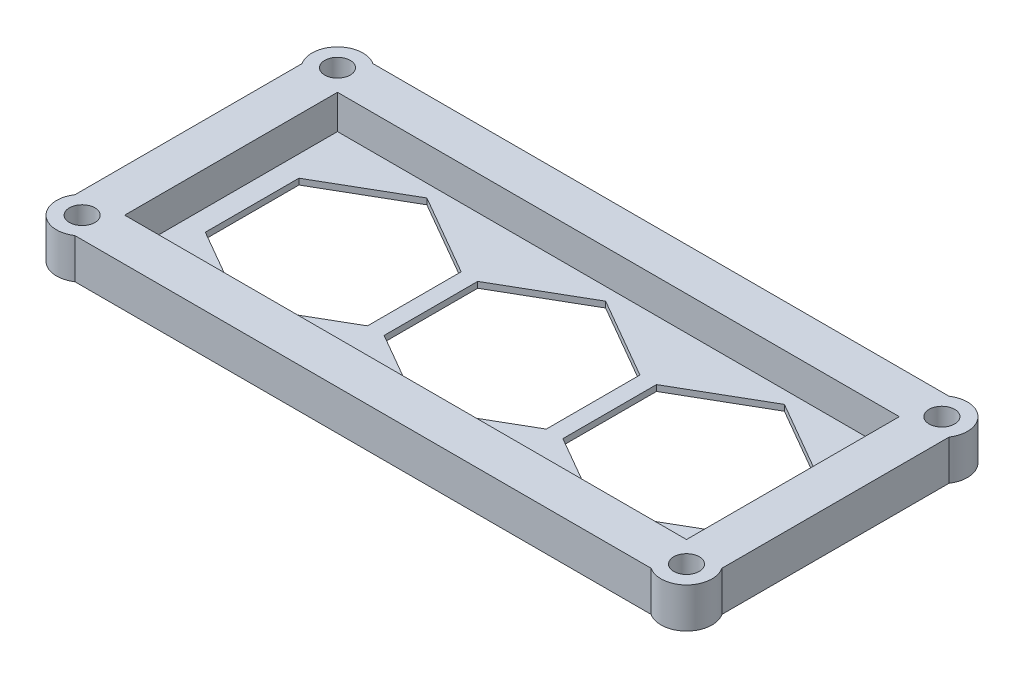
ISO-10303-21;
HEADER;
FILE_DESCRIPTION(('STEP AP214'),'2;1');
FILE_NAME('part.step','',(''),(''),'','','');
FILE_SCHEMA(('AUTOMOTIVE_DESIGN { 1 0 10303 214 1 1 1 1 }'));
ENDSEC;
DATA;
#1=APPLICATION_CONTEXT('core data for automotive mechanical design processes');
#2=APPLICATION_PROTOCOL_DEFINITION('international standard','automotive_design',2000,#1);
#3=PRODUCT_CONTEXT('',#1,'mechanical');
#4=PRODUCT('Part','Part','',(#3));
#5=PRODUCT_RELATED_PRODUCT_CATEGORY('part','',(#4));
#6=PRODUCT_DEFINITION_FORMATION('','',#4);
#7=PRODUCT_DEFINITION_CONTEXT('part definition',#1,'design');
#8=PRODUCT_DEFINITION('design','',#6,#7);
#9=PRODUCT_DEFINITION_SHAPE('','',#8);
#10=(LENGTH_UNIT() NAMED_UNIT(*) SI_UNIT(.MILLI.,.METRE.));
#11=(NAMED_UNIT(*) PLANE_ANGLE_UNIT() SI_UNIT($,.RADIAN.));
#12=(NAMED_UNIT(*) SI_UNIT($,.STERADIAN.) SOLID_ANGLE_UNIT());
#13=UNCERTAINTY_MEASURE_WITH_UNIT(LENGTH_MEASURE(1.E-05),#10,'distance_accuracy_value','');
#14=(GEOMETRIC_REPRESENTATION_CONTEXT(3) GLOBAL_UNCERTAINTY_ASSIGNED_CONTEXT((#13)) GLOBAL_UNIT_ASSIGNED_CONTEXT((#10,
#11,#12)) REPRESENTATION_CONTEXT('',''));
#15=CARTESIAN_POINT('',(0.,0.,0.));
#16=DIRECTION('',(0.,0.,1.));
#17=DIRECTION('',(1.,0.,0.));
#18=AXIS2_PLACEMENT_3D('',#15,#16,#17);
#19=CARTESIAN_POINT('',(31.7096354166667,0.7,-20.7083333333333));
#20=DIRECTION('',(0.,1.,0.));
#21=DIRECTION('',(0.,0.,1.));
#22=AXIS2_PLACEMENT_3D('',#19,#20,#21);
#23=PLANE('',#22);
#24=DIRECTION('',(-1.,0.,0.));
#25=VECTOR('',#24,1.);
#26=CARTESIAN_POINT('',(-36.7903645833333,0.7,-18.2083333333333));
#27=LINE('',#26,#25);
#28=CARTESIAN_POINT('',(29.2096354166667,0.7,-18.2083333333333));
#29=VERTEX_POINT('',#28);
#30=CARTESIAN_POINT('',(-36.7903645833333,0.7,-18.2083333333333));
#31=VERTEX_POINT('',#30);
#32=EDGE_CURVE('E47',#29,#31,#27,.T.);
#33=ORIENTED_EDGE('',*,*,#32,.T.);
#34=DIRECTION('',(0.,0.,1.));
#35=VECTOR('',#34,1.);
#36=CARTESIAN_POINT('',(-36.7903645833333,0.7,-18.2083333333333));
#37=LINE('',#36,#35);
#38=CARTESIAN_POINT('',(-36.7903645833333,0.7,6.79166666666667));
#39=VERTEX_POINT('',#38);
#40=EDGE_CURVE('E51',#31,#39,#37,.T.);
#41=ORIENTED_EDGE('',*,*,#40,.T.);
#42=DIRECTION('',(1.,0.,0.));
#43=VECTOR('',#42,1.);
#44=CARTESIAN_POINT('',(-36.7903645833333,0.7,6.79166666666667));
#45=LINE('',#44,#43);
#46=CARTESIAN_POINT('',(29.2096354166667,0.7,6.79166666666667));
#47=VERTEX_POINT('',#46);
#48=EDGE_CURVE('E260',#39,#47,#45,.T.);
#49=ORIENTED_EDGE('',*,*,#48,.T.);
#50=DIRECTION('',(0.,0.,-1.));
#51=VECTOR('',#50,1.);
#52=CARTESIAN_POINT('',(29.2096354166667,0.7,-18.2083333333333));
#53=LINE('',#52,#51);
#54=EDGE_CURVE('E238',#47,#29,#53,.T.);
#55=ORIENTED_EDGE('',*,*,#54,.T.);
#56=EDGE_LOOP('',(#33,#41,#49,#55));
#57=FACE_BOUND('',#56,.T.);
#58=DIRECTION('',(-0.866025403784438,0.,0.500000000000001));
#59=VECTOR('',#58,1.);
#60=CARTESIAN_POINT('',(17.2096354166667,0.7,-16.7083333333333));
#61=LINE('',#60,#59);
#62=CARTESIAN_POINT('',(17.2096354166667,0.7,-16.7083333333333));
#63=VERTEX_POINT('',#62);
#64=CARTESIAN_POINT('',(7.68335597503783,0.7,-11.2083333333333));
#65=VERTEX_POINT('',#64);
#66=EDGE_CURVE('E345',#63,#65,#61,.T.);
#67=ORIENTED_EDGE('',*,*,#66,.F.);
#68=DIRECTION('',(-0.866025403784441,0.,-0.499999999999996));
#69=VECTOR('',#68,1.);
#70=CARTESIAN_POINT('',(26.7359148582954,0.7,-11.2083333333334));
#71=LINE('',#70,#69);
#72=CARTESIAN_POINT('',(26.7359148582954,0.7,-11.2083333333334));
#73=VERTEX_POINT('',#72);
#74=EDGE_CURVE('E343',#73,#63,#71,.T.);
#75=ORIENTED_EDGE('',*,*,#74,.F.);
#76=DIRECTION('',(0.,0.,-1.));
#77=VECTOR('',#76,1.);
#78=CARTESIAN_POINT('',(26.7359148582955,0.7,-0.208333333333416));
#79=LINE('',#78,#77);
#80=CARTESIAN_POINT('',(26.7359148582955,0.7,-0.208333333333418));
#81=VERTEX_POINT('',#80);
#82=EDGE_CURVE('E355',#81,#73,#79,.T.);
#83=ORIENTED_EDGE('',*,*,#82,.F.);
#84=DIRECTION('',(0.866025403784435,0.,-0.500000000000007));
#85=VECTOR('',#84,1.);
#86=CARTESIAN_POINT('',(17.2096354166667,0.7,5.29166666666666));
#87=LINE('',#86,#85);
#88=CARTESIAN_POINT('',(17.2096354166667,0.7,5.29166666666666));
#89=VERTEX_POINT('',#88);
#90=EDGE_CURVE('E352',#89,#81,#87,.T.);
#91=ORIENTED_EDGE('',*,*,#90,.F.);
#92=DIRECTION('',(0.866025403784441,0.,0.499999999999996));
#93=VECTOR('',#92,1.);
#94=CARTESIAN_POINT('',(7.68335597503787,0.7,-0.208333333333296));
#95=LINE('',#94,#93);
#96=CARTESIAN_POINT('',(7.68335597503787,0.7,-0.208333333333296));
#97=VERTEX_POINT('',#96);
#98=EDGE_CURVE('E350',#97,#89,#95,.T.);
#99=ORIENTED_EDGE('',*,*,#98,.F.);
#100=DIRECTION('',(0.,0.,1.));
#101=VECTOR('',#100,1.);
#102=CARTESIAN_POINT('',(7.68335597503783,0.7,-11.2083333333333));
#103=LINE('',#102,#101);
#104=EDGE_CURVE('E348',#65,#97,#103,.T.);
#105=ORIENTED_EDGE('',*,*,#104,.F.);
#106=EDGE_LOOP('',(#67,#75,#83,#91,#99,#105));
#107=FACE_BOUND('',#106,.T.);
#108=DIRECTION('',(-0.866025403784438,0.,0.500000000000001));
#109=VECTOR('',#108,1.);
#110=CARTESIAN_POINT('',(-3.79036458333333,0.7,-16.7083333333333));
#111=LINE('',#110,#109);
#112=CARTESIAN_POINT('',(-3.79036458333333,0.7,-16.7083333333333));
#113=VERTEX_POINT('',#112);
#114=CARTESIAN_POINT('',(-13.3166440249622,0.7,-11.2083333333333));
#115=VERTEX_POINT('',#114);
#116=EDGE_CURVE('E390',#113,#115,#111,.T.);
#117=ORIENTED_EDGE('',*,*,#116,.F.);
#118=DIRECTION('',(-0.866025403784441,0.,-0.499999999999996));
#119=VECTOR('',#118,1.);
#120=CARTESIAN_POINT('',(5.73591485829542,0.7,-11.2083333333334));
#121=LINE('',#120,#119);
#122=CARTESIAN_POINT('',(5.73591485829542,0.7,-11.2083333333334));
#123=VERTEX_POINT('',#122);
#124=EDGE_CURVE('E388',#123,#113,#121,.T.);
#125=ORIENTED_EDGE('',*,*,#124,.F.);
#126=DIRECTION('',(0.,0.,-1.));
#127=VECTOR('',#126,1.);
#128=CARTESIAN_POINT('',(5.73591485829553,0.7,-0.208333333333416));
#129=LINE('',#128,#127);
#130=CARTESIAN_POINT('',(5.73591485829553,0.7,-0.208333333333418));
#131=VERTEX_POINT('',#130);
#132=EDGE_CURVE('E400',#131,#123,#129,.T.);
#133=ORIENTED_EDGE('',*,*,#132,.F.);
#134=DIRECTION('',(0.866025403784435,0.,-0.500000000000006));
#135=VECTOR('',#134,1.);
#136=CARTESIAN_POINT('',(-3.79036458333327,0.7,5.29166666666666));
#137=LINE('',#136,#135);
#138=CARTESIAN_POINT('',(-3.79036458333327,0.7,5.29166666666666));
#139=VERTEX_POINT('',#138);
#140=EDGE_CURVE('E397',#139,#131,#137,.T.);
#141=ORIENTED_EDGE('',*,*,#140,.F.);
#142=DIRECTION('',(0.866025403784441,0.,0.499999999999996));
#143=VECTOR('',#142,1.);
#144=CARTESIAN_POINT('',(-13.3166440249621,0.7,-0.208333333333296));
#145=LINE('',#144,#143);
#146=CARTESIAN_POINT('',(-13.3166440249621,0.7,-0.208333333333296));
#147=VERTEX_POINT('',#146);
#148=EDGE_CURVE('E395',#147,#139,#145,.T.);
#149=ORIENTED_EDGE('',*,*,#148,.F.);
#150=DIRECTION('',(0.,0.,1.));
#151=VECTOR('',#150,1.);
#152=CARTESIAN_POINT('',(-13.3166440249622,0.7,-11.2083333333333));
#153=LINE('',#152,#151);
#154=EDGE_CURVE('E393',#115,#147,#153,.T.);
#155=ORIENTED_EDGE('',*,*,#154,.F.);
#156=EDGE_LOOP('',(#117,#125,#133,#141,#149,#155));
#157=FACE_BOUND('',#156,.T.);
#158=DIRECTION('',(-0.866025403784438,0.,0.500000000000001));
#159=VECTOR('',#158,1.);
#160=CARTESIAN_POINT('',(-24.7903645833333,0.7,-16.7083333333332));
#161=LINE('',#160,#159);
#162=CARTESIAN_POINT('',(-24.7903645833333,0.7,-16.7083333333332));
#163=VERTEX_POINT('',#162);
#164=CARTESIAN_POINT('',(-34.3166440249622,0.7,-11.2083333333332));
#165=VERTEX_POINT('',#164);
#166=EDGE_CURVE('E300',#163,#165,#161,.T.);
#167=ORIENTED_EDGE('',*,*,#166,.F.);
#168=DIRECTION('',(-0.866025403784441,0.,-0.499999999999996));
#169=VECTOR('',#168,1.);
#170=CARTESIAN_POINT('',(-15.2640851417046,0.7,-11.2083333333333));
#171=LINE('',#170,#169);
#172=CARTESIAN_POINT('',(-15.2640851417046,0.7,-11.2083333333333));
#173=VERTEX_POINT('',#172);
#174=EDGE_CURVE('E298',#173,#163,#171,.T.);
#175=ORIENTED_EDGE('',*,*,#174,.F.);
#176=DIRECTION('',(0.,0.,-1.));
#177=VECTOR('',#176,1.);
#178=CARTESIAN_POINT('',(-15.2640851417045,0.7,-0.20833333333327));
#179=LINE('',#178,#177);
#180=CARTESIAN_POINT('',(-15.2640851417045,0.7,-0.208333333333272));
#181=VERTEX_POINT('',#180);
#182=EDGE_CURVE('E310',#181,#173,#179,.T.);
#183=ORIENTED_EDGE('',*,*,#182,.F.);
#184=DIRECTION('',(0.866025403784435,0.,-0.500000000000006));
#185=VECTOR('',#184,1.);
#186=CARTESIAN_POINT('',(-24.7903645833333,0.7,5.29166666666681));
#187=LINE('',#186,#185);
#188=CARTESIAN_POINT('',(-24.7903645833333,0.7,5.29166666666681));
#189=VERTEX_POINT('',#188);
#190=EDGE_CURVE('E307',#189,#181,#187,.T.);
#191=ORIENTED_EDGE('',*,*,#190,.F.);
#192=DIRECTION('',(0.866025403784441,0.,0.499999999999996));
#193=VECTOR('',#192,1.);
#194=CARTESIAN_POINT('',(-34.3166440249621,0.7,-0.208333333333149));
#195=LINE('',#194,#193);
#196=CARTESIAN_POINT('',(-34.3166440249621,0.7,-0.208333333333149));
#197=VERTEX_POINT('',#196);
#198=EDGE_CURVE('E305',#197,#189,#195,.T.);
#199=ORIENTED_EDGE('',*,*,#198,.F.);
#200=DIRECTION('',(0.,0.,1.));
#201=VECTOR('',#200,1.);
#202=CARTESIAN_POINT('',(-34.3166440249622,0.7,-11.2083333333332));
#203=LINE('',#202,#201);
#204=EDGE_CURVE('E303',#165,#197,#203,.T.);
#205=ORIENTED_EDGE('',*,*,#204,.F.);
#206=EDGE_LOOP('',(#167,#175,#183,#191,#199,#205));
#207=FACE_BOUND('',#206,.T.);
#208=ADVANCED_FACE('F32',(#57,#107,#157,#207),#23,.T.);
#209=CARTESIAN_POINT('',(31.7096354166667,0.,-20.7083333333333));
#210=DIRECTION('',(0.,1.,0.));
#211=DIRECTION('',(0.,0.,1.));
#212=AXIS2_PLACEMENT_3D('',#209,#210,#211);
#213=PLANE('',#212);
#214=DIRECTION('',(-0.866025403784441,0.,-0.499999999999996));
#215=VECTOR('',#214,1.);
#216=CARTESIAN_POINT('',(26.7359148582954,0.,-11.2083333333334));
#217=LINE('',#216,#215);
#218=CARTESIAN_POINT('',(26.7359148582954,0.,-11.2083333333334));
#219=VERTEX_POINT('',#218);
#220=CARTESIAN_POINT('',(17.2096354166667,0.,-16.7083333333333));
#221=VERTEX_POINT('',#220);
#222=EDGE_CURVE('E342',#219,#221,#217,.T.);
#223=ORIENTED_EDGE('',*,*,#222,.T.);
#224=DIRECTION('',(-0.866025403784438,0.,0.500000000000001));
#225=VECTOR('',#224,1.);
#226=CARTESIAN_POINT('',(17.2096354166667,0.,-16.7083333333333));
#227=LINE('',#226,#225);
#228=CARTESIAN_POINT('',(7.68335597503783,0.,-11.2083333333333));
#229=VERTEX_POINT('',#228);
#230=EDGE_CURVE('E360',#221,#229,#227,.T.);
#231=ORIENTED_EDGE('',*,*,#230,.T.);
#232=DIRECTION('',(0.,0.,1.));
#233=VECTOR('',#232,1.);
#234=CARTESIAN_POINT('',(7.68335597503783,0.,-11.2083333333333));
#235=LINE('',#234,#233);
#236=CARTESIAN_POINT('',(7.68335597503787,0.,-0.208333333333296));
#237=VERTEX_POINT('',#236);
#238=EDGE_CURVE('E363',#229,#237,#235,.T.);
#239=ORIENTED_EDGE('',*,*,#238,.T.);
#240=DIRECTION('',(0.866025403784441,0.,0.499999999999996));
#241=VECTOR('',#240,1.);
#242=CARTESIAN_POINT('',(7.68335597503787,0.,-0.208333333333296));
#243=LINE('',#242,#241);
#244=CARTESIAN_POINT('',(17.2096354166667,0.,5.29166666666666));
#245=VERTEX_POINT('',#244);
#246=EDGE_CURVE('E366',#237,#245,#243,.T.);
#247=ORIENTED_EDGE('',*,*,#246,.T.);
#248=DIRECTION('',(0.866025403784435,0.,-0.500000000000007));
#249=VECTOR('',#248,1.);
#250=CARTESIAN_POINT('',(17.2096354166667,0.,5.29166666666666));
#251=LINE('',#250,#249);
#252=CARTESIAN_POINT('',(26.7359148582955,0.,-0.208333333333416));
#253=VERTEX_POINT('',#252);
#254=EDGE_CURVE('E369',#245,#253,#251,.T.);
#255=ORIENTED_EDGE('',*,*,#254,.T.);
#256=DIRECTION('',(0.,0.,-1.));
#257=VECTOR('',#256,1.);
#258=CARTESIAN_POINT('',(26.7359148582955,0.,-0.208333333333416));
#259=LINE('',#258,#257);
#260=EDGE_CURVE('E346',#253,#219,#259,.T.);
#261=ORIENTED_EDGE('',*,*,#260,.T.);
#262=EDGE_LOOP('',(#223,#231,#239,#247,#255,#261));
#263=FACE_BOUND('',#262,.T.);
#264=CARTESIAN_POINT('',(31.7096354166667,0.,-20.7083333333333));
#265=DIRECTION('',(0.,1.,0.));
#266=DIRECTION('',(0.,0.,1.));
#267=AXIS2_PLACEMENT_3D('',#264,#265,#266);
#268=CIRCLE('',#267,1.5);
#269=CARTESIAN_POINT('',(31.7096354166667,0.,-19.2083333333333));
#270=VERTEX_POINT('',#269);
#271=EDGE_CURVE('E432',#270,#270,#268,.T.);
#272=ORIENTED_EDGE('',*,*,#271,.T.);
#273=EDGE_LOOP('',(#272));
#274=FACE_BOUND('',#273,.T.);
#275=CARTESIAN_POINT('',(-39.2903645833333,0.,9.29166666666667));
#276=DIRECTION('',(0.,1.,0.));
#277=DIRECTION('',(0.,0.,1.));
#278=AXIS2_PLACEMENT_3D('',#275,#276,#277);
#279=CIRCLE('',#278,1.5);
#280=CARTESIAN_POINT('',(-39.2903645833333,0.,10.7916666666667));
#281=VERTEX_POINT('',#280);
#282=EDGE_CURVE('E438',#281,#281,#279,.T.);
#283=ORIENTED_EDGE('',*,*,#282,.T.);
#284=EDGE_LOOP('',(#283));
#285=FACE_BOUND('',#284,.T.);
#286=CARTESIAN_POINT('',(31.7096354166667,0.,-20.7083333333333));
#287=DIRECTION('',(0.,1.,0.));
#288=DIRECTION('',(0.,0.,1.));
#289=AXIS2_PLACEMENT_3D('',#286,#287,#288);
#290=CIRCLE('',#289,3.);
#291=CARTESIAN_POINT('',(34.2096354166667,0.,-19.0500209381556));
#292=VERTEX_POINT('',#291);
#293=CARTESIAN_POINT('',(30.051323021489,0.,-23.2083333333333));
#294=VERTEX_POINT('',#293);
#295=EDGE_CURVE('E444',#292,#294,#290,.T.);
#296=ORIENTED_EDGE('',*,*,#295,.F.);
#297=DIRECTION('',(0.,0.,-1.));
#298=VECTOR('',#297,1.);
#299=CARTESIAN_POINT('',(34.2096354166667,0.,-19.0500209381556));
#300=LINE('',#299,#298);
#301=CARTESIAN_POINT('',(34.2096354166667,0.,7.63335427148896));
#302=VERTEX_POINT('',#301);
#303=EDGE_CURVE('E459',#302,#292,#300,.T.);
#304=ORIENTED_EDGE('',*,*,#303,.F.);
#305=CARTESIAN_POINT('',(31.7096354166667,0.,9.29166666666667));
#306=DIRECTION('',(0.,1.,0.));
#307=DIRECTION('',(0.,0.,1.));
#308=AXIS2_PLACEMENT_3D('',#305,#306,#307);
#309=CIRCLE('',#308,3.);
#310=CARTESIAN_POINT('',(30.051323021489,0.,11.7916666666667));
#311=VERTEX_POINT('',#310);
#312=EDGE_CURVE('E457',#311,#302,#309,.T.);
#313=ORIENTED_EDGE('',*,*,#312,.F.);
#314=DIRECTION('',(1.,0.,0.));
#315=VECTOR('',#314,1.);
#316=CARTESIAN_POINT('',(-37.6320521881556,0.,11.7916666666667));
#317=LINE('',#316,#315);
#318=CARTESIAN_POINT('',(-37.6320521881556,0.,11.7916666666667));
#319=VERTEX_POINT('',#318);
#320=EDGE_CURVE('E455',#319,#311,#317,.T.);
#321=ORIENTED_EDGE('',*,*,#320,.F.);
#322=CARTESIAN_POINT('',(-39.2903645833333,0.,9.29166666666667));
#323=DIRECTION('',(0.,1.,0.));
#324=DIRECTION('',(0.,0.,1.));
#325=AXIS2_PLACEMENT_3D('',#322,#323,#324);
#326=CIRCLE('',#325,3.);
#327=CARTESIAN_POINT('',(-41.7903645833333,0.,7.63335427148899));
#328=VERTEX_POINT('',#327);
#329=EDGE_CURVE('E453',#328,#319,#326,.T.);
#330=ORIENTED_EDGE('',*,*,#329,.F.);
#331=DIRECTION('',(0.,0.,1.));
#332=VECTOR('',#331,1.);
#333=CARTESIAN_POINT('',(-41.7903645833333,0.,-19.0500209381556));
#334=LINE('',#333,#332);
#335=CARTESIAN_POINT('',(-41.7903645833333,0.,-19.0500209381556));
#336=VERTEX_POINT('',#335);
#337=EDGE_CURVE('E451',#336,#328,#334,.T.);
#338=ORIENTED_EDGE('',*,*,#337,.F.);
#339=CARTESIAN_POINT('',(-39.2903645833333,0.,-20.7083333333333));
#340=DIRECTION('',(0.,1.,0.));
#341=DIRECTION('',(0.,0.,1.));
#342=AXIS2_PLACEMENT_3D('',#339,#340,#341);
#343=CIRCLE('',#342,3.);
#344=CARTESIAN_POINT('',(-37.6320521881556,0.,-23.2083333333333));
#345=VERTEX_POINT('',#344);
#346=EDGE_CURVE('E449',#345,#336,#343,.T.);
#347=ORIENTED_EDGE('',*,*,#346,.F.);
#348=DIRECTION('',(-1.,0.,0.));
#349=VECTOR('',#348,1.);
#350=CARTESIAN_POINT('',(-37.6320521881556,0.,-23.2083333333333));
#351=LINE('',#350,#349);
#352=EDGE_CURVE('E447',#294,#345,#351,.T.);
#353=ORIENTED_EDGE('',*,*,#352,.F.);
#354=EDGE_LOOP('',(#296,#304,#313,#321,#330,#338,#347,#353));
#355=FACE_BOUND('',#354,.T.);
#356=CARTESIAN_POINT('',(-39.2903645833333,0.,-20.7083333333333));
#357=DIRECTION('',(0.,1.,0.));
#358=DIRECTION('',(0.,0.,1.));
#359=AXIS2_PLACEMENT_3D('',#356,#357,#358);
#360=CIRCLE('',#359,1.5);
#361=CARTESIAN_POINT('',(-39.2903645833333,0.,-19.2083333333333));
#362=VERTEX_POINT('',#361);
#363=EDGE_CURVE('E441',#362,#362,#360,.T.);
#364=ORIENTED_EDGE('',*,*,#363,.T.);
#365=EDGE_LOOP('',(#364));
#366=FACE_BOUND('',#365,.T.);
#367=CARTESIAN_POINT('',(31.7096354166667,0.,9.29166666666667));
#368=DIRECTION('',(0.,1.,0.));
#369=DIRECTION('',(0.,0.,1.));
#370=AXIS2_PLACEMENT_3D('',#367,#368,#369);
#371=CIRCLE('',#370,1.5);
#372=CARTESIAN_POINT('',(31.7096354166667,0.,10.7916666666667));
#373=VERTEX_POINT('',#372);
#374=EDGE_CURVE('E435',#373,#373,#371,.T.);
#375=ORIENTED_EDGE('',*,*,#374,.T.);
#376=EDGE_LOOP('',(#375));
#377=FACE_BOUND('',#376,.T.);
#378=DIRECTION('',(-0.866025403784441,0.,-0.499999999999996));
#379=VECTOR('',#378,1.);
#380=CARTESIAN_POINT('',(5.73591485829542,0.,-11.2083333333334));
#381=LINE('',#380,#379);
#382=CARTESIAN_POINT('',(5.73591485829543,0.,-11.2083333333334));
#383=VERTEX_POINT('',#382);
#384=CARTESIAN_POINT('',(-3.79036458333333,0.,-16.7083333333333));
#385=VERTEX_POINT('',#384);
#386=EDGE_CURVE('E387',#383,#385,#381,.T.);
#387=ORIENTED_EDGE('',*,*,#386,.T.);
#388=DIRECTION('',(-0.866025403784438,0.,0.500000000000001));
#389=VECTOR('',#388,1.);
#390=CARTESIAN_POINT('',(-3.79036458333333,0.,-16.7083333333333));
#391=LINE('',#390,#389);
#392=CARTESIAN_POINT('',(-13.3166440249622,0.,-11.2083333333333));
#393=VERTEX_POINT('',#392);
#394=EDGE_CURVE('E405',#385,#393,#391,.T.);
#395=ORIENTED_EDGE('',*,*,#394,.T.);
#396=DIRECTION('',(0.,0.,1.));
#397=VECTOR('',#396,1.);
#398=CARTESIAN_POINT('',(-13.3166440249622,0.,-11.2083333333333));
#399=LINE('',#398,#397);
#400=CARTESIAN_POINT('',(-13.3166440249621,0.,-0.208333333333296));
#401=VERTEX_POINT('',#400);
#402=EDGE_CURVE('E408',#393,#401,#399,.T.);
#403=ORIENTED_EDGE('',*,*,#402,.T.);
#404=DIRECTION('',(0.866025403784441,0.,0.499999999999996));
#405=VECTOR('',#404,1.);
#406=CARTESIAN_POINT('',(-13.3166440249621,0.,-0.208333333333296));
#407=LINE('',#406,#405);
#408=CARTESIAN_POINT('',(-3.79036458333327,0.,5.29166666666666));
#409=VERTEX_POINT('',#408);
#410=EDGE_CURVE('E411',#401,#409,#407,.T.);
#411=ORIENTED_EDGE('',*,*,#410,.T.);
#412=DIRECTION('',(0.866025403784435,0.,-0.500000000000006));
#413=VECTOR('',#412,1.);
#414=CARTESIAN_POINT('',(-3.79036458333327,0.,5.29166666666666));
#415=LINE('',#414,#413);
#416=CARTESIAN_POINT('',(5.73591485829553,0.,-0.208333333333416));
#417=VERTEX_POINT('',#416);
#418=EDGE_CURVE('E414',#409,#417,#415,.T.);
#419=ORIENTED_EDGE('',*,*,#418,.T.);
#420=DIRECTION('',(0.,0.,-1.));
#421=VECTOR('',#420,1.);
#422=CARTESIAN_POINT('',(5.73591485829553,0.,-0.208333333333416));
#423=LINE('',#422,#421);
#424=EDGE_CURVE('E391',#417,#383,#423,.T.);
#425=ORIENTED_EDGE('',*,*,#424,.T.);
#426=EDGE_LOOP('',(#387,#395,#403,#411,#419,#425));
#427=FACE_BOUND('',#426,.T.);
#428=DIRECTION('',(-0.866025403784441,0.,-0.499999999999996));
#429=VECTOR('',#428,1.);
#430=CARTESIAN_POINT('',(-15.2640851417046,0.,-11.2083333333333));
#431=LINE('',#430,#429);
#432=CARTESIAN_POINT('',(-15.2640851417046,0.,-11.2083333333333));
#433=VERTEX_POINT('',#432);
#434=CARTESIAN_POINT('',(-24.7903645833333,0.,-16.7083333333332));
#435=VERTEX_POINT('',#434);
#436=EDGE_CURVE('E297',#433,#435,#431,.T.);
#437=ORIENTED_EDGE('',*,*,#436,.T.);
#438=DIRECTION('',(-0.866025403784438,0.,0.500000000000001));
#439=VECTOR('',#438,1.);
#440=CARTESIAN_POINT('',(-24.7903645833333,0.,-16.7083333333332));
#441=LINE('',#440,#439);
#442=CARTESIAN_POINT('',(-34.3166440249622,0.,-11.2083333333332));
#443=VERTEX_POINT('',#442);
#444=EDGE_CURVE('E315',#435,#443,#441,.T.);
#445=ORIENTED_EDGE('',*,*,#444,.T.);
#446=DIRECTION('',(0.,0.,1.));
#447=VECTOR('',#446,1.);
#448=CARTESIAN_POINT('',(-34.3166440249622,0.,-11.2083333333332));
#449=LINE('',#448,#447);
#450=CARTESIAN_POINT('',(-34.3166440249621,0.,-0.208333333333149));
#451=VERTEX_POINT('',#450);
#452=EDGE_CURVE('E318',#443,#451,#449,.T.);
#453=ORIENTED_EDGE('',*,*,#452,.T.);
#454=DIRECTION('',(0.866025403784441,0.,0.499999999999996));
#455=VECTOR('',#454,1.);
#456=CARTESIAN_POINT('',(-34.3166440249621,0.,-0.208333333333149));
#457=LINE('',#456,#455);
#458=CARTESIAN_POINT('',(-24.7903645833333,0.,5.29166666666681));
#459=VERTEX_POINT('',#458);
#460=EDGE_CURVE('E321',#451,#459,#457,.T.);
#461=ORIENTED_EDGE('',*,*,#460,.T.);
#462=DIRECTION('',(0.866025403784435,0.,-0.500000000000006));
#463=VECTOR('',#462,1.);
#464=CARTESIAN_POINT('',(-24.7903645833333,0.,5.29166666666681));
#465=LINE('',#464,#463);
#466=CARTESIAN_POINT('',(-15.2640851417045,0.,-0.20833333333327));
#467=VERTEX_POINT('',#466);
#468=EDGE_CURVE('E324',#459,#467,#465,.T.);
#469=ORIENTED_EDGE('',*,*,#468,.T.);
#470=DIRECTION('',(0.,0.,-1.));
#471=VECTOR('',#470,1.);
#472=CARTESIAN_POINT('',(-15.2640851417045,0.,-0.20833333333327));
#473=LINE('',#472,#471);
#474=EDGE_CURVE('E301',#467,#433,#473,.T.);
#475=ORIENTED_EDGE('',*,*,#474,.T.);
#476=EDGE_LOOP('',(#437,#445,#453,#461,#469,#475));
#477=FACE_BOUND('',#476,.T.);
#478=ADVANCED_FACE('F488',(#263,#274,#285,#355,#366,#377,#427,#477),#213,.F.);
#479=CARTESIAN_POINT('',(31.7096354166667,0.7,-20.7083333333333));
#480=DIRECTION('',(0.,-1.,0.));
#481=DIRECTION('',(0.,0.,-1.));
#482=AXIS2_PLACEMENT_3D('',#479,#480,#481);
#483=CYLINDRICAL_SURFACE('',#482,3.);
#484=ORIENTED_EDGE('',*,*,#295,.T.);
#485=DIRECTION('',(0.,-1.,0.));
#486=VECTOR('',#485,1.);
#487=CARTESIAN_POINT('',(30.051323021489,0.7,-23.2083333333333));
#488=LINE('',#487,#486);
#489=CARTESIAN_POINT('',(30.051323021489,4.7,-23.2083333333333));
#490=VERTEX_POINT('',#489);
#491=EDGE_CURVE('E11',#490,#294,#488,.T.);
#492=ORIENTED_EDGE('',*,*,#491,.F.);
#493=CARTESIAN_POINT('',(31.7096354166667,4.7,-20.7083333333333));
#494=DIRECTION('',(0.,1.,0.));
#495=DIRECTION('',(0.,0.,1.));
#496=AXIS2_PLACEMENT_3D('',#493,#494,#495);
#497=CIRCLE('',#496,3.);
#498=CARTESIAN_POINT('',(34.2096354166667,4.7,-19.0500209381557));
#499=VERTEX_POINT('',#498);
#500=EDGE_CURVE('E291',#499,#490,#497,.T.);
#501=ORIENTED_EDGE('',*,*,#500,.F.);
#502=DIRECTION('',(0.,-1.,0.));
#503=VECTOR('',#502,1.);
#504=CARTESIAN_POINT('',(34.2096354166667,0.7,-19.0500209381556));
#505=LINE('',#504,#503);
#506=EDGE_CURVE('E461',#499,#292,#505,.T.);
#507=ORIENTED_EDGE('',*,*,#506,.T.);
#508=EDGE_LOOP('',(#484,#492,#501,#507));
#509=FACE_BOUND('',#508,.T.);
#510=ADVANCED_FACE('F34',(#509),#483,.T.);
#511=CARTESIAN_POINT('',(-37.6320521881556,0.7,-23.2083333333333));
#512=DIRECTION('',(0.,0.,1.));
#513=DIRECTION('',(1.,0.,0.));
#514=AXIS2_PLACEMENT_3D('',#511,#512,#513);
#515=PLANE('',#514);
#516=ORIENTED_EDGE('',*,*,#352,.T.);
#517=DIRECTION('',(0.,-1.,0.));
#518=VECTOR('',#517,1.);
#519=CARTESIAN_POINT('',(-37.6320521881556,0.7,-23.2083333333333));
#520=LINE('',#519,#518);
#521=CARTESIAN_POINT('',(-37.6320521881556,4.7,-23.2083333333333));
#522=VERTEX_POINT('',#521);
#523=EDGE_CURVE('E40',#522,#345,#520,.T.);
#524=ORIENTED_EDGE('',*,*,#523,.F.);
#525=DIRECTION('',(-1.,0.,0.));
#526=VECTOR('',#525,1.);
#527=CARTESIAN_POINT('',(-37.6320521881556,4.7,-23.2083333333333));
#528=LINE('',#527,#526);
#529=EDGE_CURVE('E294',#490,#522,#528,.T.);
#530=ORIENTED_EDGE('',*,*,#529,.F.);
#531=ORIENTED_EDGE('',*,*,#491,.T.);
#532=EDGE_LOOP('',(#516,#524,#530,#531));
#533=FACE_BOUND('',#532,.T.);
#534=ADVANCED_FACE('F513',(#533),#515,.F.);
#535=CARTESIAN_POINT('',(-39.2903645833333,0.7,-20.7083333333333));
#536=DIRECTION('',(0.,-1.,0.));
#537=DIRECTION('',(0.,0.,-1.));
#538=AXIS2_PLACEMENT_3D('',#535,#536,#537);
#539=CYLINDRICAL_SURFACE('',#538,3.);
#540=ORIENTED_EDGE('',*,*,#346,.T.);
#541=DIRECTION('',(0.,-1.,0.));
#542=VECTOR('',#541,1.);
#543=CARTESIAN_POINT('',(-41.7903645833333,0.7,-19.0500209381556));
#544=LINE('',#543,#542);
#545=CARTESIAN_POINT('',(-41.7903645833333,4.7,-19.0500209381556));
#546=VERTEX_POINT('',#545);
#547=EDGE_CURVE('E476',#546,#336,#544,.T.);
#548=ORIENTED_EDGE('',*,*,#547,.F.);
#549=CARTESIAN_POINT('',(-39.2903645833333,4.7,-20.7083333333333));
#550=DIRECTION('',(0.,1.,0.));
#551=DIRECTION('',(0.,0.,1.));
#552=AXIS2_PLACEMENT_3D('',#549,#550,#551);
#553=CIRCLE('',#552,3.);
#554=EDGE_CURVE('E273',#522,#546,#553,.T.);
#555=ORIENTED_EDGE('',*,*,#554,.F.);
#556=ORIENTED_EDGE('',*,*,#523,.T.);
#557=EDGE_LOOP('',(#540,#548,#555,#556));
#558=FACE_BOUND('',#557,.T.);
#559=ADVANCED_FACE('F482',(#558),#539,.T.);
#560=CARTESIAN_POINT('',(-41.7903645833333,0.7,-19.0500209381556));
#561=DIRECTION('',(1.,0.,0.));
#562=DIRECTION('',(0.,0.,-1.));
#563=AXIS2_PLACEMENT_3D('',#560,#561,#562);
#564=PLANE('',#563);
#565=ORIENTED_EDGE('',*,*,#337,.T.);
#566=DIRECTION('',(0.,-1.,0.));
#567=VECTOR('',#566,1.);
#568=CARTESIAN_POINT('',(-41.7903645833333,0.7,7.63335427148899));
#569=LINE('',#568,#567);
#570=CARTESIAN_POINT('',(-41.7903645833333,4.7,7.63335427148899));
#571=VERTEX_POINT('',#570);
#572=EDGE_CURVE('E473',#571,#328,#569,.T.);
#573=ORIENTED_EDGE('',*,*,#572,.F.);
#574=DIRECTION('',(0.,0.,1.));
#575=VECTOR('',#574,1.);
#576=CARTESIAN_POINT('',(-41.7903645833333,4.7,-19.0500209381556));
#577=LINE('',#576,#575);
#578=EDGE_CURVE('E276',#546,#571,#577,.T.);
#579=ORIENTED_EDGE('',*,*,#578,.F.);
#580=ORIENTED_EDGE('',*,*,#547,.T.);
#581=EDGE_LOOP('',(#565,#573,#579,#580));
#582=FACE_BOUND('',#581,.T.);
#583=ADVANCED_FACE('F493',(#582),#564,.F.);
#584=CARTESIAN_POINT('',(-39.2903645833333,0.7,9.29166666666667));
#585=DIRECTION('',(0.,-1.,0.));
#586=DIRECTION('',(0.,0.,-1.));
#587=AXIS2_PLACEMENT_3D('',#584,#585,#586);
#588=CYLINDRICAL_SURFACE('',#587,3.);
#589=ORIENTED_EDGE('',*,*,#329,.T.);
#590=DIRECTION('',(0.,-1.,0.));
#591=VECTOR('',#590,1.);
#592=CARTESIAN_POINT('',(-37.6320521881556,0.7,11.7916666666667));
#593=LINE('',#592,#591);
#594=CARTESIAN_POINT('',(-37.6320521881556,4.7,11.7916666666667));
#595=VERTEX_POINT('',#594);
#596=EDGE_CURVE('E470',#595,#319,#593,.T.);
#597=ORIENTED_EDGE('',*,*,#596,.F.);
#598=CARTESIAN_POINT('',(-39.2903645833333,4.7,9.29166666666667));
#599=DIRECTION('',(0.,1.,0.));
#600=DIRECTION('',(0.,0.,1.));
#601=AXIS2_PLACEMENT_3D('',#598,#599,#600);
#602=CIRCLE('',#601,3.);
#603=EDGE_CURVE('E279',#571,#595,#602,.T.);
#604=ORIENTED_EDGE('',*,*,#603,.F.);
#605=ORIENTED_EDGE('',*,*,#572,.T.);
#606=EDGE_LOOP('',(#589,#597,#604,#605));
#607=FACE_BOUND('',#606,.T.);
#608=ADVANCED_FACE('F497',(#607),#588,.T.);
#609=CARTESIAN_POINT('',(-37.6320521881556,0.7,11.7916666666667));
#610=DIRECTION('',(0.,0.,-1.));
#611=DIRECTION('',(-1.,0.,0.));
#612=AXIS2_PLACEMENT_3D('',#609,#610,#611);
#613=PLANE('',#612);
#614=ORIENTED_EDGE('',*,*,#320,.T.);
#615=DIRECTION('',(0.,-1.,0.));
#616=VECTOR('',#615,1.);
#617=CARTESIAN_POINT('',(30.051323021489,0.7,11.7916666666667));
#618=LINE('',#617,#616);
#619=CARTESIAN_POINT('',(30.051323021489,4.7,11.7916666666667));
#620=VERTEX_POINT('',#619);
#621=EDGE_CURVE('E467',#620,#311,#618,.T.);
#622=ORIENTED_EDGE('',*,*,#621,.F.);
#623=DIRECTION('',(1.,0.,0.));
#624=VECTOR('',#623,1.);
#625=CARTESIAN_POINT('',(-37.6320521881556,4.7,11.7916666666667));
#626=LINE('',#625,#624);
#627=EDGE_CURVE('E282',#595,#620,#626,.T.);
#628=ORIENTED_EDGE('',*,*,#627,.F.);
#629=ORIENTED_EDGE('',*,*,#596,.T.);
#630=EDGE_LOOP('',(#614,#622,#628,#629));
#631=FACE_BOUND('',#630,.T.);
#632=ADVANCED_FACE('F503',(#631),#613,.F.);
#633=CARTESIAN_POINT('',(31.7096354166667,0.7,9.29166666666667));
#634=DIRECTION('',(0.,-1.,0.));
#635=DIRECTION('',(0.,0.,-1.));
#636=AXIS2_PLACEMENT_3D('',#633,#634,#635);
#637=CYLINDRICAL_SURFACE('',#636,3.);
#638=ORIENTED_EDGE('',*,*,#312,.T.);
#639=DIRECTION('',(0.,-1.,0.));
#640=VECTOR('',#639,1.);
#641=CARTESIAN_POINT('',(34.2096354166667,0.7,7.63335427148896));
#642=LINE('',#641,#640);
#643=CARTESIAN_POINT('',(34.2096354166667,4.7,7.63335427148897));
#644=VERTEX_POINT('',#643);
#645=EDGE_CURVE('E464',#644,#302,#642,.T.);
#646=ORIENTED_EDGE('',*,*,#645,.F.);
#647=CARTESIAN_POINT('',(31.7096354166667,4.7,9.29166666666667));
#648=DIRECTION('',(0.,1.,0.));
#649=DIRECTION('',(0.,0.,1.));
#650=AXIS2_PLACEMENT_3D('',#647,#648,#649);
#651=CIRCLE('',#650,3.);
#652=EDGE_CURVE('E285',#620,#644,#651,.T.);
#653=ORIENTED_EDGE('',*,*,#652,.F.);
#654=ORIENTED_EDGE('',*,*,#621,.T.);
#655=EDGE_LOOP('',(#638,#646,#653,#654));
#656=FACE_BOUND('',#655,.T.);
#657=ADVANCED_FACE('F506',(#656),#637,.T.);
#658=CARTESIAN_POINT('',(34.2096354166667,0.7,-19.0500209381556));
#659=DIRECTION('',(-1.,0.,0.));
#660=DIRECTION('',(0.,0.,1.));
#661=AXIS2_PLACEMENT_3D('',#658,#659,#660);
#662=PLANE('',#661);
#663=ORIENTED_EDGE('',*,*,#303,.T.);
#664=ORIENTED_EDGE('',*,*,#506,.F.);
#665=DIRECTION('',(0.,0.,-1.));
#666=VECTOR('',#665,1.);
#667=CARTESIAN_POINT('',(34.2096354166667,4.7,-19.0500209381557));
#668=LINE('',#667,#666);
#669=EDGE_CURVE('E288',#644,#499,#668,.T.);
#670=ORIENTED_EDGE('',*,*,#669,.F.);
#671=ORIENTED_EDGE('',*,*,#645,.T.);
#672=EDGE_LOOP('',(#663,#664,#670,#671));
#673=FACE_BOUND('',#672,.T.);
#674=ADVANCED_FACE('F509',(#673),#662,.F.);
#675=CARTESIAN_POINT('',(-39.2903645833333,0.7,-20.7083333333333));
#676=DIRECTION('',(0.,-1.,0.));
#677=DIRECTION('',(0.,0.,-1.));
#678=AXIS2_PLACEMENT_3D('',#675,#676,#677);
#679=CYLINDRICAL_SURFACE('',#678,1.5);
#680=ORIENTED_EDGE('',*,*,#363,.F.);
#681=EDGE_LOOP('',(#680));
#682=FACE_BOUND('',#681,.T.);
#683=CARTESIAN_POINT('',(-39.2903645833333,4.7,-20.7083333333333));
#684=DIRECTION('',(0.,1.,0.));
#685=DIRECTION('',(0.,0.,1.));
#686=AXIS2_PLACEMENT_3D('',#683,#684,#685);
#687=CIRCLE('',#686,1.5);
#688=CARTESIAN_POINT('',(-39.2903645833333,4.7,-19.2083333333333));
#689=VERTEX_POINT('',#688);
#690=EDGE_CURVE('E243',#689,#689,#687,.T.);
#691=ORIENTED_EDGE('',*,*,#690,.T.);
#692=EDGE_LOOP('',(#691));
#693=FACE_BOUND('',#692,.T.);
#694=ADVANCED_FACE('F529',(#682,#693),#679,.F.);
#695=CARTESIAN_POINT('',(-39.2903645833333,0.7,9.29166666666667));
#696=DIRECTION('',(0.,-1.,0.));
#697=DIRECTION('',(0.,0.,-1.));
#698=AXIS2_PLACEMENT_3D('',#695,#696,#697);
#699=CYLINDRICAL_SURFACE('',#698,1.5);
#700=ORIENTED_EDGE('',*,*,#282,.F.);
#701=EDGE_LOOP('',(#700));
#702=FACE_BOUND('',#701,.T.);
#703=CARTESIAN_POINT('',(-39.2903645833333,4.7,9.29166666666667));
#704=DIRECTION('',(0.,1.,0.));
#705=DIRECTION('',(0.,0.,1.));
#706=AXIS2_PLACEMENT_3D('',#703,#704,#705);
#707=CIRCLE('',#706,1.5);
#708=CARTESIAN_POINT('',(-39.2903645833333,4.7,10.7916666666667));
#709=VERTEX_POINT('',#708);
#710=EDGE_CURVE('E270',#709,#709,#707,.T.);
#711=ORIENTED_EDGE('',*,*,#710,.T.);
#712=EDGE_LOOP('',(#711));
#713=FACE_BOUND('',#712,.T.);
#714=ADVANCED_FACE('F567',(#702,#713),#699,.F.);
#715=CARTESIAN_POINT('',(31.7096354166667,0.7,9.29166666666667));
#716=DIRECTION('',(0.,-1.,0.));
#717=DIRECTION('',(0.,0.,-1.));
#718=AXIS2_PLACEMENT_3D('',#715,#716,#717);
#719=CYLINDRICAL_SURFACE('',#718,1.5);
#720=ORIENTED_EDGE('',*,*,#374,.F.);
#721=EDGE_LOOP('',(#720));
#722=FACE_BOUND('',#721,.T.);
#723=CARTESIAN_POINT('',(31.7096354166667,4.7,9.29166666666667));
#724=DIRECTION('',(0.,1.,0.));
#725=DIRECTION('',(0.,0.,1.));
#726=AXIS2_PLACEMENT_3D('',#723,#724,#725);
#727=CIRCLE('',#726,1.5);
#728=CARTESIAN_POINT('',(31.7096354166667,4.7,10.7916666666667));
#729=VERTEX_POINT('',#728);
#730=EDGE_CURVE('E903',#729,#729,#727,.T.);
#731=ORIENTED_EDGE('',*,*,#730,.T.);
#732=EDGE_LOOP('',(#731));
#733=FACE_BOUND('',#732,.T.);
#734=ADVANCED_FACE('F574',(#722,#733),#719,.F.);
#735=CARTESIAN_POINT('',(31.7096354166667,0.7,-20.7083333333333));
#736=DIRECTION('',(0.,-1.,0.));
#737=DIRECTION('',(0.,0.,-1.));
#738=AXIS2_PLACEMENT_3D('',#735,#736,#737);
#739=CYLINDRICAL_SURFACE('',#738,1.5);
#740=ORIENTED_EDGE('',*,*,#271,.F.);
#741=EDGE_LOOP('',(#740));
#742=FACE_BOUND('',#741,.T.);
#743=CARTESIAN_POINT('',(31.7096354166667,4.7,-20.7083333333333));
#744=DIRECTION('',(0.,1.,0.));
#745=DIRECTION('',(0.,0.,1.));
#746=AXIS2_PLACEMENT_3D('',#743,#744,#745);
#747=CIRCLE('',#746,1.5);
#748=CARTESIAN_POINT('',(31.7096354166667,4.7,-19.2083333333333));
#749=VERTEX_POINT('',#748);
#750=EDGE_CURVE('E258',#749,#749,#747,.T.);
#751=ORIENTED_EDGE('',*,*,#750,.T.);
#752=EDGE_LOOP('',(#751));
#753=FACE_BOUND('',#752,.T.);
#754=ADVANCED_FACE('F581',(#742,#753),#739,.F.);
#755=CARTESIAN_POINT('',(5.73591485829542,0.7,-11.2083333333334));
#756=DIRECTION('',(-0.499999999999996,0.,0.866025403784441));
#757=DIRECTION('',(0.866025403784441,0.,0.499999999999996));
#758=AXIS2_PLACEMENT_3D('',#755,#756,#757);
#759=PLANE('',#758);
#760=ORIENTED_EDGE('',*,*,#386,.F.);
#761=DIRECTION('',(0.,-1.,0.));
#762=VECTOR('',#761,1.);
#763=CARTESIAN_POINT('',(5.73591485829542,0.7,-11.2083333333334));
#764=LINE('',#763,#762);
#765=EDGE_CURVE('E402',#123,#383,#764,.T.);
#766=ORIENTED_EDGE('',*,*,#765,.F.);
#767=ORIENTED_EDGE('',*,*,#124,.T.);
#768=DIRECTION('',(0.,-1.,0.));
#769=VECTOR('',#768,1.);
#770=CARTESIAN_POINT('',(-3.79036458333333,0.7,-16.7083333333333));
#771=LINE('',#770,#769);
#772=EDGE_CURVE('E429',#113,#385,#771,.T.);
#773=ORIENTED_EDGE('',*,*,#772,.T.);
#774=EDGE_LOOP('',(#760,#766,#767,#773));
#775=FACE_BOUND('',#774,.T.);
#776=ADVANCED_FACE('F589',(#775),#759,.T.);
#777=CARTESIAN_POINT('',(-3.79036458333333,0.7,-16.7083333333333));
#778=DIRECTION('',(0.500000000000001,0.,0.866025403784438));
#779=DIRECTION('',(0.866025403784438,0.,-0.500000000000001));
#780=AXIS2_PLACEMENT_3D('',#777,#778,#779);
#781=PLANE('',#780);
#782=ORIENTED_EDGE('',*,*,#394,.F.);
#783=ORIENTED_EDGE('',*,*,#772,.F.);
#784=ORIENTED_EDGE('',*,*,#116,.T.);
#785=DIRECTION('',(0.,-1.,0.));
#786=VECTOR('',#785,1.);
#787=CARTESIAN_POINT('',(-13.3166440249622,0.7,-11.2083333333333));
#788=LINE('',#787,#786);
#789=EDGE_CURVE('E427',#115,#393,#788,.T.);
#790=ORIENTED_EDGE('',*,*,#789,.T.);
#791=EDGE_LOOP('',(#782,#783,#784,#790));
#792=FACE_BOUND('',#791,.T.);
#793=ADVANCED_FACE('F598',(#792),#781,.T.);
#794=CARTESIAN_POINT('',(-13.3166440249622,0.7,-11.2083333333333));
#795=DIRECTION('',(1.,0.,0.));
#796=DIRECTION('',(0.,0.,-1.));
#797=AXIS2_PLACEMENT_3D('',#794,#795,#796);
#798=PLANE('',#797);
#799=ORIENTED_EDGE('',*,*,#402,.F.);
#800=ORIENTED_EDGE('',*,*,#789,.F.);
#801=ORIENTED_EDGE('',*,*,#154,.T.);
#802=DIRECTION('',(0.,-1.,0.));
#803=VECTOR('',#802,1.);
#804=CARTESIAN_POINT('',(-13.3166440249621,0.7,-0.208333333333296));
#805=LINE('',#804,#803);
#806=EDGE_CURVE('E425',#147,#401,#805,.T.);
#807=ORIENTED_EDGE('',*,*,#806,.T.);
#808=EDGE_LOOP('',(#799,#800,#801,#807));
#809=FACE_BOUND('',#808,.T.);
#810=ADVANCED_FACE('F607',(#809),#798,.T.);
#811=CARTESIAN_POINT('',(-13.3166440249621,0.7,-0.208333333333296));
#812=DIRECTION('',(0.499999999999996,0.,-0.866025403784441));
#813=DIRECTION('',(-0.866025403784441,0.,-0.499999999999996));
#814=AXIS2_PLACEMENT_3D('',#811,#812,#813);
#815=PLANE('',#814);
#816=ORIENTED_EDGE('',*,*,#410,.F.);
#817=ORIENTED_EDGE('',*,*,#806,.F.);
#818=ORIENTED_EDGE('',*,*,#148,.T.);
#819=DIRECTION('',(0.,-1.,0.));
#820=VECTOR('',#819,1.);
#821=CARTESIAN_POINT('',(-3.79036458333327,0.7,5.29166666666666));
#822=LINE('',#821,#820);
#823=EDGE_CURVE('E423',#139,#409,#822,.T.);
#824=ORIENTED_EDGE('',*,*,#823,.T.);
#825=EDGE_LOOP('',(#816,#817,#818,#824));
#826=FACE_BOUND('',#825,.T.);
#827=ADVANCED_FACE('F615',(#826),#815,.T.);
#828=CARTESIAN_POINT('',(-3.79036458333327,0.7,5.29166666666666));
#829=DIRECTION('',(-0.500000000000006,0.,-0.866025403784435));
#830=DIRECTION('',(-0.866025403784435,0.,0.500000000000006));
#831=AXIS2_PLACEMENT_3D('',#828,#829,#830);
#832=PLANE('',#831);
#833=ORIENTED_EDGE('',*,*,#418,.F.);
#834=ORIENTED_EDGE('',*,*,#823,.F.);
#835=ORIENTED_EDGE('',*,*,#140,.T.);
#836=DIRECTION('',(0.,-1.,0.));
#837=VECTOR('',#836,1.);
#838=CARTESIAN_POINT('',(5.73591485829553,0.7,-0.208333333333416));
#839=LINE('',#838,#837);
#840=EDGE_CURVE('E421',#131,#417,#839,.T.);
#841=ORIENTED_EDGE('',*,*,#840,.T.);
#842=EDGE_LOOP('',(#833,#834,#835,#841));
#843=FACE_BOUND('',#842,.T.);
#844=ADVANCED_FACE('F623',(#843),#832,.T.);
#845=CARTESIAN_POINT('',(5.73591485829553,0.7,-0.208333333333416));
#846=DIRECTION('',(-1.,0.,0.));
#847=DIRECTION('',(0.,0.,1.));
#848=AXIS2_PLACEMENT_3D('',#845,#846,#847);
#849=PLANE('',#848);
#850=ORIENTED_EDGE('',*,*,#424,.F.);
#851=ORIENTED_EDGE('',*,*,#840,.F.);
#852=ORIENTED_EDGE('',*,*,#132,.T.);
#853=ORIENTED_EDGE('',*,*,#765,.T.);
#854=EDGE_LOOP('',(#850,#851,#852,#853));
#855=FACE_BOUND('',#854,.T.);
#856=ADVANCED_FACE('F631',(#855),#849,.T.);
#857=CARTESIAN_POINT('',(26.7359148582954,0.7,-11.2083333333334));
#858=DIRECTION('',(-0.499999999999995,0.,0.866025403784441));
#859=DIRECTION('',(0.866025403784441,0.,0.499999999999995));
#860=AXIS2_PLACEMENT_3D('',#857,#858,#859);
#861=PLANE('',#860);
#862=ORIENTED_EDGE('',*,*,#222,.F.);
#863=DIRECTION('',(0.,-1.,0.));
#864=VECTOR('',#863,1.);
#865=CARTESIAN_POINT('',(26.7359148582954,0.7,-11.2083333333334));
#866=LINE('',#865,#864);
#867=EDGE_CURVE('E357',#73,#219,#866,.T.);
#868=ORIENTED_EDGE('',*,*,#867,.F.);
#869=ORIENTED_EDGE('',*,*,#74,.T.);
#870=DIRECTION('',(0.,-1.,0.));
#871=VECTOR('',#870,1.);
#872=CARTESIAN_POINT('',(17.2096354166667,0.7,-16.7083333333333));
#873=LINE('',#872,#871);
#874=EDGE_CURVE('E384',#63,#221,#873,.T.);
#875=ORIENTED_EDGE('',*,*,#874,.T.);
#876=EDGE_LOOP('',(#862,#868,#869,#875));
#877=FACE_BOUND('',#876,.T.);
#878=ADVANCED_FACE('F639',(#877),#861,.T.);
#879=CARTESIAN_POINT('',(17.2096354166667,0.7,-16.7083333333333));
#880=DIRECTION('',(0.500000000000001,0.,0.866025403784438));
#881=DIRECTION('',(0.866025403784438,0.,-0.500000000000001));
#882=AXIS2_PLACEMENT_3D('',#879,#880,#881);
#883=PLANE('',#882);
#884=ORIENTED_EDGE('',*,*,#230,.F.);
#885=ORIENTED_EDGE('',*,*,#874,.F.);
#886=ORIENTED_EDGE('',*,*,#66,.T.);
#887=DIRECTION('',(0.,-1.,0.));
#888=VECTOR('',#887,1.);
#889=CARTESIAN_POINT('',(7.68335597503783,0.7,-11.2083333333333));
#890=LINE('',#889,#888);
#891=EDGE_CURVE('E382',#65,#229,#890,.T.);
#892=ORIENTED_EDGE('',*,*,#891,.T.);
#893=EDGE_LOOP('',(#884,#885,#886,#892));
#894=FACE_BOUND('',#893,.T.);
#895=ADVANCED_FACE('F647',(#894),#883,.T.);
#896=CARTESIAN_POINT('',(7.68335597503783,0.7,-11.2083333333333));
#897=DIRECTION('',(1.,0.,0.));
#898=DIRECTION('',(0.,0.,-1.));
#899=AXIS2_PLACEMENT_3D('',#896,#897,#898);
#900=PLANE('',#899);
#901=ORIENTED_EDGE('',*,*,#238,.F.);
#902=ORIENTED_EDGE('',*,*,#891,.F.);
#903=ORIENTED_EDGE('',*,*,#104,.T.);
#904=DIRECTION('',(0.,-1.,0.));
#905=VECTOR('',#904,1.);
#906=CARTESIAN_POINT('',(7.68335597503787,0.7,-0.208333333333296));
#907=LINE('',#906,#905);
#908=EDGE_CURVE('E380',#97,#237,#907,.T.);
#909=ORIENTED_EDGE('',*,*,#908,.T.);
#910=EDGE_LOOP('',(#901,#902,#903,#909));
#911=FACE_BOUND('',#910,.T.);
#912=ADVANCED_FACE('F655',(#911),#900,.T.);
#913=CARTESIAN_POINT('',(7.68335597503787,0.7,-0.208333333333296));
#914=DIRECTION('',(0.499999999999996,0.,-0.866025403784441));
#915=DIRECTION('',(-0.866025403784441,0.,-0.499999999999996));
#916=AXIS2_PLACEMENT_3D('',#913,#914,#915);
#917=PLANE('',#916);
#918=ORIENTED_EDGE('',*,*,#246,.F.);
#919=ORIENTED_EDGE('',*,*,#908,.F.);
#920=ORIENTED_EDGE('',*,*,#98,.T.);
#921=DIRECTION('',(0.,-1.,0.));
#922=VECTOR('',#921,1.);
#923=CARTESIAN_POINT('',(17.2096354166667,0.7,5.29166666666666));
#924=LINE('',#923,#922);
#925=EDGE_CURVE('E378',#89,#245,#924,.T.);
#926=ORIENTED_EDGE('',*,*,#925,.T.);
#927=EDGE_LOOP('',(#918,#919,#920,#926));
#928=FACE_BOUND('',#927,.T.);
#929=ADVANCED_FACE('F663',(#928),#917,.T.);
#930=CARTESIAN_POINT('',(17.2096354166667,0.7,5.29166666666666));
#931=DIRECTION('',(-0.500000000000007,0.,-0.866025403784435));
#932=DIRECTION('',(-0.866025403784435,0.,0.500000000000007));
#933=AXIS2_PLACEMENT_3D('',#930,#931,#932);
#934=PLANE('',#933);
#935=ORIENTED_EDGE('',*,*,#254,.F.);
#936=ORIENTED_EDGE('',*,*,#925,.F.);
#937=ORIENTED_EDGE('',*,*,#90,.T.);
#938=DIRECTION('',(0.,-1.,0.));
#939=VECTOR('',#938,1.);
#940=CARTESIAN_POINT('',(26.7359148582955,0.7,-0.208333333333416));
#941=LINE('',#940,#939);
#942=EDGE_CURVE('E376',#81,#253,#941,.T.);
#943=ORIENTED_EDGE('',*,*,#942,.T.);
#944=EDGE_LOOP('',(#935,#936,#937,#943));
#945=FACE_BOUND('',#944,.T.);
#946=ADVANCED_FACE('F671',(#945),#934,.T.);
#947=CARTESIAN_POINT('',(26.7359148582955,0.7,-0.208333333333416));
#948=DIRECTION('',(-1.,0.,0.));
#949=DIRECTION('',(0.,0.,1.));
#950=AXIS2_PLACEMENT_3D('',#947,#948,#949);
#951=PLANE('',#950);
#952=ORIENTED_EDGE('',*,*,#260,.F.);
#953=ORIENTED_EDGE('',*,*,#942,.F.);
#954=ORIENTED_EDGE('',*,*,#82,.T.);
#955=ORIENTED_EDGE('',*,*,#867,.T.);
#956=EDGE_LOOP('',(#952,#953,#954,#955));
#957=FACE_BOUND('',#956,.T.);
#958=ADVANCED_FACE('F679',(#957),#951,.T.);
#959=CARTESIAN_POINT('',(-15.2640851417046,0.7,-11.2083333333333));
#960=DIRECTION('',(-0.499999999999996,0.,0.866025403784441));
#961=DIRECTION('',(0.866025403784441,0.,0.499999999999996));
#962=AXIS2_PLACEMENT_3D('',#959,#960,#961);
#963=PLANE('',#962);
#964=ORIENTED_EDGE('',*,*,#436,.F.);
#965=DIRECTION('',(0.,-1.,0.));
#966=VECTOR('',#965,1.);
#967=CARTESIAN_POINT('',(-15.2640851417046,0.7,-11.2083333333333));
#968=LINE('',#967,#966);
#969=EDGE_CURVE('E312',#173,#433,#968,.T.);
#970=ORIENTED_EDGE('',*,*,#969,.F.);
#971=ORIENTED_EDGE('',*,*,#174,.T.);
#972=DIRECTION('',(0.,-1.,0.));
#973=VECTOR('',#972,1.);
#974=CARTESIAN_POINT('',(-24.7903645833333,0.7,-16.7083333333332));
#975=LINE('',#974,#973);
#976=EDGE_CURVE('E339',#163,#435,#975,.T.);
#977=ORIENTED_EDGE('',*,*,#976,.T.);
#978=EDGE_LOOP('',(#964,#970,#971,#977));
#979=FACE_BOUND('',#978,.T.);
#980=ADVANCED_FACE('F687',(#979),#963,.T.);
#981=CARTESIAN_POINT('',(-24.7903645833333,0.7,-16.7083333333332));
#982=DIRECTION('',(0.500000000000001,0.,0.866025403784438));
#983=DIRECTION('',(0.866025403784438,0.,-0.500000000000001));
#984=AXIS2_PLACEMENT_3D('',#981,#982,#983);
#985=PLANE('',#984);
#986=ORIENTED_EDGE('',*,*,#444,.F.);
#987=ORIENTED_EDGE('',*,*,#976,.F.);
#988=ORIENTED_EDGE('',*,*,#166,.T.);
#989=DIRECTION('',(0.,-1.,0.));
#990=VECTOR('',#989,1.);
#991=CARTESIAN_POINT('',(-34.3166440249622,0.7,-11.2083333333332));
#992=LINE('',#991,#990);
#993=EDGE_CURVE('E337',#165,#443,#992,.T.);
#994=ORIENTED_EDGE('',*,*,#993,.T.);
#995=EDGE_LOOP('',(#986,#987,#988,#994));
#996=FACE_BOUND('',#995,.T.);
#997=ADVANCED_FACE('F695',(#996),#985,.T.);
#998=CARTESIAN_POINT('',(-34.3166440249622,0.7,-11.2083333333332));
#999=DIRECTION('',(1.,0.,0.));
#1000=DIRECTION('',(0.,0.,-1.));
#1001=AXIS2_PLACEMENT_3D('',#998,#999,#1000);
#1002=PLANE('',#1001);
#1003=ORIENTED_EDGE('',*,*,#452,.F.);
#1004=ORIENTED_EDGE('',*,*,#993,.F.);
#1005=ORIENTED_EDGE('',*,*,#204,.T.);
#1006=DIRECTION('',(0.,-1.,0.));
#1007=VECTOR('',#1006,1.);
#1008=CARTESIAN_POINT('',(-34.3166440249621,0.7,-0.208333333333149));
#1009=LINE('',#1008,#1007);
#1010=EDGE_CURVE('E335',#197,#451,#1009,.T.);
#1011=ORIENTED_EDGE('',*,*,#1010,.T.);
#1012=EDGE_LOOP('',(#1003,#1004,#1005,#1011));
#1013=FACE_BOUND('',#1012,.T.);
#1014=ADVANCED_FACE('F703',(#1013),#1002,.T.);
#1015=CARTESIAN_POINT('',(-34.3166440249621,0.7,-0.208333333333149));
#1016=DIRECTION('',(0.499999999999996,0.,-0.866025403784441));
#1017=DIRECTION('',(-0.866025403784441,0.,-0.499999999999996));
#1018=AXIS2_PLACEMENT_3D('',#1015,#1016,#1017);
#1019=PLANE('',#1018);
#1020=ORIENTED_EDGE('',*,*,#460,.F.);
#1021=ORIENTED_EDGE('',*,*,#1010,.F.);
#1022=ORIENTED_EDGE('',*,*,#198,.T.);
#1023=DIRECTION('',(0.,-1.,0.));
#1024=VECTOR('',#1023,1.);
#1025=CARTESIAN_POINT('',(-24.7903645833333,0.7,5.29166666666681));
#1026=LINE('',#1025,#1024);
#1027=EDGE_CURVE('E333',#189,#459,#1026,.T.);
#1028=ORIENTED_EDGE('',*,*,#1027,.T.);
#1029=EDGE_LOOP('',(#1020,#1021,#1022,#1028));
#1030=FACE_BOUND('',#1029,.T.);
#1031=ADVANCED_FACE('F711',(#1030),#1019,.T.);
#1032=CARTESIAN_POINT('',(-24.7903645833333,0.7,5.29166666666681));
#1033=DIRECTION('',(-0.500000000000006,0.,-0.866025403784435));
#1034=DIRECTION('',(-0.866025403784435,0.,0.500000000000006));
#1035=AXIS2_PLACEMENT_3D('',#1032,#1033,#1034);
#1036=PLANE('',#1035);
#1037=ORIENTED_EDGE('',*,*,#468,.F.);
#1038=ORIENTED_EDGE('',*,*,#1027,.F.);
#1039=ORIENTED_EDGE('',*,*,#190,.T.);
#1040=DIRECTION('',(0.,-1.,0.));
#1041=VECTOR('',#1040,1.);
#1042=CARTESIAN_POINT('',(-15.2640851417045,0.7,-0.20833333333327));
#1043=LINE('',#1042,#1041);
#1044=EDGE_CURVE('E331',#181,#467,#1043,.T.);
#1045=ORIENTED_EDGE('',*,*,#1044,.T.);
#1046=EDGE_LOOP('',(#1037,#1038,#1039,#1045));
#1047=FACE_BOUND('',#1046,.T.);
#1048=ADVANCED_FACE('F719',(#1047),#1036,.T.);
#1049=CARTESIAN_POINT('',(-15.2640851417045,0.7,-0.20833333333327));
#1050=DIRECTION('',(-1.,0.,0.));
#1051=DIRECTION('',(0.,0.,1.));
#1052=AXIS2_PLACEMENT_3D('',#1049,#1050,#1051);
#1053=PLANE('',#1052);
#1054=ORIENTED_EDGE('',*,*,#474,.F.);
#1055=ORIENTED_EDGE('',*,*,#1044,.F.);
#1056=ORIENTED_EDGE('',*,*,#182,.T.);
#1057=ORIENTED_EDGE('',*,*,#969,.T.);
#1058=EDGE_LOOP('',(#1054,#1055,#1056,#1057));
#1059=FACE_BOUND('',#1058,.T.);
#1060=ADVANCED_FACE('F727',(#1059),#1053,.T.);
#1061=CARTESIAN_POINT('',(-39.2903645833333,4.7,-20.7083333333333));
#1062=DIRECTION('',(0.,1.,0.));
#1063=DIRECTION('',(0.,0.,1.));
#1064=AXIS2_PLACEMENT_3D('',#1061,#1062,#1063);
#1065=PLANE('',#1064);
#1066=ORIENTED_EDGE('',*,*,#750,.F.);
#1067=EDGE_LOOP('',(#1066));
#1068=FACE_BOUND('',#1067,.T.);
#1069=ORIENTED_EDGE('',*,*,#690,.F.);
#1070=EDGE_LOOP('',(#1069));
#1071=FACE_BOUND('',#1070,.T.);
#1072=ORIENTED_EDGE('',*,*,#554,.T.);
#1073=ORIENTED_EDGE('',*,*,#578,.T.);
#1074=ORIENTED_EDGE('',*,*,#603,.T.);
#1075=ORIENTED_EDGE('',*,*,#627,.T.);
#1076=ORIENTED_EDGE('',*,*,#652,.T.);
#1077=ORIENTED_EDGE('',*,*,#669,.T.);
#1078=ORIENTED_EDGE('',*,*,#500,.T.);
#1079=ORIENTED_EDGE('',*,*,#529,.T.);
#1080=EDGE_LOOP('',(#1072,#1073,#1074,#1075,#1076,#1077,#1078,#1079));
#1081=FACE_BOUND('',#1080,.T.);
#1082=ORIENTED_EDGE('',*,*,#710,.F.);
#1083=EDGE_LOOP('',(#1082));
#1084=FACE_BOUND('',#1083,.T.);
#1085=DIRECTION('',(0.,0.,1.));
#1086=VECTOR('',#1085,1.);
#1087=CARTESIAN_POINT('',(-36.7903645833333,4.7,-18.2083333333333));
#1088=LINE('',#1087,#1086);
#1089=CARTESIAN_POINT('',(-36.7903645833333,4.7,-18.2083333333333));
#1090=VERTEX_POINT('',#1089);
#1091=CARTESIAN_POINT('',(-36.7903645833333,4.7,6.79166666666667));
#1092=VERTEX_POINT('',#1091);
#1093=EDGE_CURVE('E237',#1090,#1092,#1088,.T.);
#1094=ORIENTED_EDGE('',*,*,#1093,.F.);
#1095=DIRECTION('',(-1.,0.,0.));
#1096=VECTOR('',#1095,1.);
#1097=CARTESIAN_POINT('',(-36.7903645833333,4.7,-18.2083333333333));
#1098=LINE('',#1097,#1096);
#1099=CARTESIAN_POINT('',(29.2096354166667,4.7,-18.2083333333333));
#1100=VERTEX_POINT('',#1099);
#1101=EDGE_CURVE('E228',#1100,#1090,#1098,.T.);
#1102=ORIENTED_EDGE('',*,*,#1101,.F.);
#1103=DIRECTION('',(0.,0.,-1.));
#1104=VECTOR('',#1103,1.);
#1105=CARTESIAN_POINT('',(29.2096354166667,4.7,-18.2083333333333));
#1106=LINE('',#1105,#1104);
#1107=CARTESIAN_POINT('',(29.2096354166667,4.7,6.79166666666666));
#1108=VERTEX_POINT('',#1107);
#1109=EDGE_CURVE('E252',#1108,#1100,#1106,.T.);
#1110=ORIENTED_EDGE('',*,*,#1109,.F.);
#1111=DIRECTION('',(1.,0.,0.));
#1112=VECTOR('',#1111,1.);
#1113=CARTESIAN_POINT('',(-36.7903645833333,4.7,6.79166666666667));
#1114=LINE('',#1113,#1112);
#1115=EDGE_CURVE('E250',#1092,#1108,#1114,.T.);
#1116=ORIENTED_EDGE('',*,*,#1115,.F.);
#1117=EDGE_LOOP('',(#1094,#1102,#1110,#1116));
#1118=FACE_BOUND('',#1117,.T.);
#1119=ORIENTED_EDGE('',*,*,#730,.F.);
#1120=EDGE_LOOP('',(#1119));
#1121=FACE_BOUND('',#1120,.T.);
#1122=ADVANCED_FACE('F247',(#1068,#1071,#1081,#1084,#1118,#1121),#1065,.T.);
#1123=CARTESIAN_POINT('',(-36.7903645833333,4.7,-18.2083333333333));
#1124=DIRECTION('',(0.,0.,1.));
#1125=DIRECTION('',(1.,0.,0.));
#1126=AXIS2_PLACEMENT_3D('',#1123,#1124,#1125);
#1127=PLANE('',#1126);
#1128=ORIENTED_EDGE('',*,*,#32,.F.);
#1129=DIRECTION('',(0.,-1.,0.));
#1130=VECTOR('',#1129,1.);
#1131=CARTESIAN_POINT('',(29.2096354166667,4.7,-18.2083333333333));
#1132=LINE('',#1131,#1130);
#1133=EDGE_CURVE('E233',#1100,#29,#1132,.T.);
#1134=ORIENTED_EDGE('',*,*,#1133,.F.);
#1135=ORIENTED_EDGE('',*,*,#1101,.T.);
#1136=DIRECTION('',(0.,-1.,0.));
#1137=VECTOR('',#1136,1.);
#1138=CARTESIAN_POINT('',(-36.7903645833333,4.7,-18.2083333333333));
#1139=LINE('',#1138,#1137);
#1140=EDGE_CURVE('E231',#1090,#31,#1139,.T.);
#1141=ORIENTED_EDGE('',*,*,#1140,.T.);
#1142=EDGE_LOOP('',(#1128,#1134,#1135,#1141));
#1143=FACE_BOUND('',#1142,.T.);
#1144=ADVANCED_FACE('F230',(#1143),#1127,.T.);
#1145=CARTESIAN_POINT('',(-36.7903645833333,4.7,-18.2083333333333));
#1146=DIRECTION('',(1.,0.,0.));
#1147=DIRECTION('',(0.,0.,-1.));
#1148=AXIS2_PLACEMENT_3D('',#1145,#1146,#1147);
#1149=PLANE('',#1148);
#1150=ORIENTED_EDGE('',*,*,#40,.F.);
#1151=ORIENTED_EDGE('',*,*,#1140,.F.);
#1152=ORIENTED_EDGE('',*,*,#1093,.T.);
#1153=DIRECTION('',(0.,-1.,0.));
#1154=VECTOR('',#1153,1.);
#1155=CARTESIAN_POINT('',(-36.7903645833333,4.7,6.79166666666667));
#1156=LINE('',#1155,#1154);
#1157=EDGE_CURVE('E244',#1092,#39,#1156,.T.);
#1158=ORIENTED_EDGE('',*,*,#1157,.T.);
#1159=EDGE_LOOP('',(#1150,#1151,#1152,#1158));
#1160=FACE_BOUND('',#1159,.T.);
#1161=ADVANCED_FACE('F241',(#1160),#1149,.T.);
#1162=CARTESIAN_POINT('',(-36.7903645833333,4.7,6.79166666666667));
#1163=DIRECTION('',(0.,0.,-1.));
#1164=DIRECTION('',(-1.,0.,0.));
#1165=AXIS2_PLACEMENT_3D('',#1162,#1163,#1164);
#1166=PLANE('',#1165);
#1167=ORIENTED_EDGE('',*,*,#48,.F.);
#1168=ORIENTED_EDGE('',*,*,#1157,.F.);
#1169=ORIENTED_EDGE('',*,*,#1115,.T.);
#1170=DIRECTION('',(0.,-1.,0.));
#1171=VECTOR('',#1170,1.);
#1172=CARTESIAN_POINT('',(29.2096354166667,4.7,6.79166666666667));
#1173=LINE('',#1172,#1171);
#1174=EDGE_CURVE('E264',#1108,#47,#1173,.T.);
#1175=ORIENTED_EDGE('',*,*,#1174,.T.);
#1176=EDGE_LOOP('',(#1167,#1168,#1169,#1175));
#1177=FACE_BOUND('',#1176,.T.);
#1178=ADVANCED_FACE('F754',(#1177),#1166,.T.);
#1179=CARTESIAN_POINT('',(29.2096354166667,4.7,-18.2083333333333));
#1180=DIRECTION('',(-1.,0.,0.));
#1181=DIRECTION('',(0.,0.,1.));
#1182=AXIS2_PLACEMENT_3D('',#1179,#1180,#1181);
#1183=PLANE('',#1182);
#1184=ORIENTED_EDGE('',*,*,#54,.F.);
#1185=ORIENTED_EDGE('',*,*,#1174,.F.);
#1186=ORIENTED_EDGE('',*,*,#1109,.T.);
#1187=ORIENTED_EDGE('',*,*,#1133,.T.);
#1188=EDGE_LOOP('',(#1184,#1185,#1186,#1187));
#1189=FACE_BOUND('',#1188,.T.);
#1190=ADVANCED_FACE('F761',(#1189),#1183,.T.);
#1191=CLOSED_SHELL('',(#208,#478,#510,#534,#559,#583,#608,#632,#657,#674,#694,#714,#734,#754,
#776,#793,#810,#827,#844,#856,#878,#895,#912,#929,#946,#958,#980,#997,#1014,#1031,#1048,#1060,
#1122,#1144,#1161,#1178,#1190));
#1192=MANIFOLD_SOLID_BREP('B2',#1191);
#1193=ADVANCED_BREP_SHAPE_REPRESENTATION('',(#18,#1192),#14);
#1194=SHAPE_DEFINITION_REPRESENTATION(#9,#1193);
ENDSEC;
END-ISO-10303-21;
